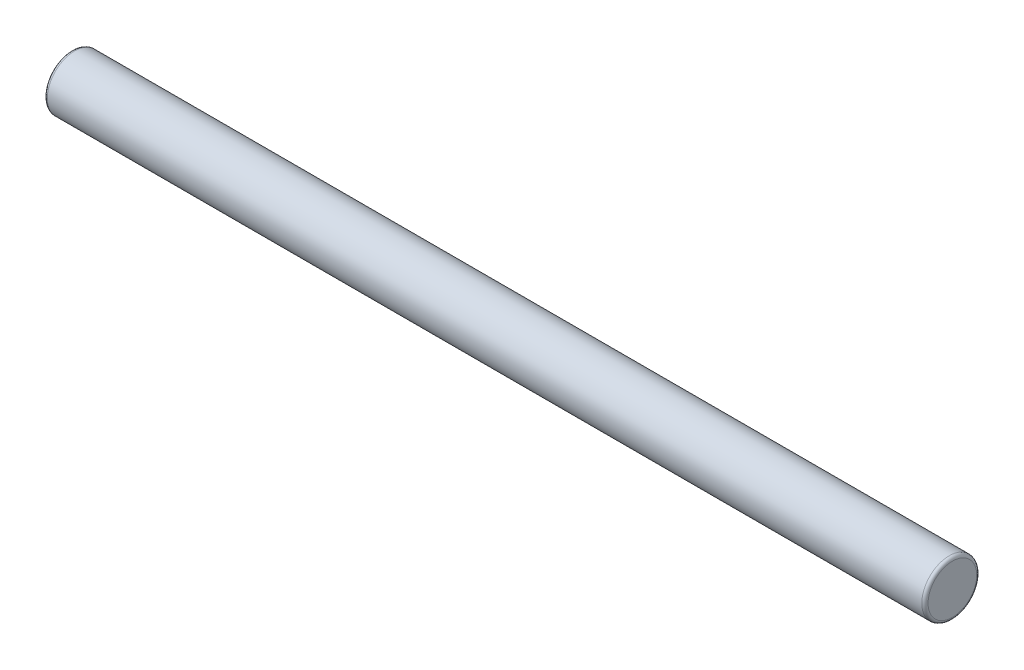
ISO-10303-21;
HEADER;
FILE_DESCRIPTION(('STEP AP214'),'2;1');
FILE_NAME('part.step','',(''),(''),'','','');
FILE_SCHEMA(('AUTOMOTIVE_DESIGN { 1 0 10303 214 1 1 1 1 }'));
ENDSEC;
DATA;
#1=APPLICATION_CONTEXT('core data for automotive mechanical design processes');
#2=APPLICATION_PROTOCOL_DEFINITION('international standard','automotive_design',2000,#1);
#3=PRODUCT_CONTEXT('',#1,'mechanical');
#4=PRODUCT('Part','Part','',(#3));
#5=PRODUCT_RELATED_PRODUCT_CATEGORY('part','',(#4));
#6=PRODUCT_DEFINITION_FORMATION('','',#4);
#7=PRODUCT_DEFINITION_CONTEXT('part definition',#1,'design');
#8=PRODUCT_DEFINITION('design','',#6,#7);
#9=PRODUCT_DEFINITION_SHAPE('','',#8);
#10=(LENGTH_UNIT() NAMED_UNIT(*) SI_UNIT(.MILLI.,.METRE.));
#11=(NAMED_UNIT(*) PLANE_ANGLE_UNIT() SI_UNIT($,.RADIAN.));
#12=(NAMED_UNIT(*) SI_UNIT($,.STERADIAN.) SOLID_ANGLE_UNIT());
#13=UNCERTAINTY_MEASURE_WITH_UNIT(LENGTH_MEASURE(1.E-05),#10,'distance_accuracy_value','');
#14=(GEOMETRIC_REPRESENTATION_CONTEXT(3) GLOBAL_UNCERTAINTY_ASSIGNED_CONTEXT((#13)) GLOBAL_UNIT_ASSIGNED_CONTEXT((#10,
#11,#12)) REPRESENTATION_CONTEXT('',''));
#15=CARTESIAN_POINT('',(0.,0.,0.));
#16=DIRECTION('',(0.,0.,1.));
#17=DIRECTION('',(1.,0.,0.));
#18=AXIS2_PLACEMENT_3D('',#15,#16,#17);
#19=CARTESIAN_POINT('',(-280.5,0.,0.));
#20=DIRECTION('',(1.,0.,0.));
#21=DIRECTION('',(0.,1.,0.));
#22=AXIS2_PLACEMENT_3D('',#19,#20,#21);
#23=PLANE('',#22);
#24=CARTESIAN_POINT('',(-280.5,0.,0.));
#25=DIRECTION('',(1.,0.,0.));
#26=DIRECTION('',(0.,1.,0.));
#27=AXIS2_PLACEMENT_3D('',#24,#25,#26);
#28=CIRCLE('',#27,15.5);
#29=CARTESIAN_POINT('',(-280.5,15.5,0.));
#30=VERTEX_POINT('',#29);
#31=EDGE_CURVE('E55',#30,#30,#28,.F.);
#32=ORIENTED_EDGE('',*,*,#31,.T.);
#33=EDGE_LOOP('',(#32));
#34=FACE_BOUND('',#33,.T.);
#35=ADVANCED_FACE('F37',(#34),#23,.F.);
#36=CARTESIAN_POINT('',(-280.5,0.,0.));
#37=DIRECTION('',(-1.,0.,0.));
#38=DIRECTION('',(0.,-1.,0.));
#39=AXIS2_PLACEMENT_3D('',#36,#37,#38);
#40=CYLINDRICAL_SURFACE('',#39,17.5);
#41=CARTESIAN_POINT('',(-278.5,0.,0.));
#42=DIRECTION('',(1.,0.,0.));
#43=DIRECTION('',(0.,1.,0.));
#44=AXIS2_PLACEMENT_3D('',#41,#42,#43);
#45=CIRCLE('',#44,17.5);
#46=CARTESIAN_POINT('',(-278.5,17.5,0.));
#47=VERTEX_POINT('',#46);
#48=EDGE_CURVE('E45',#47,#47,#45,.T.);
#49=ORIENTED_EDGE('',*,*,#48,.T.);
#50=EDGE_LOOP('',(#49));
#51=FACE_BOUND('',#50,.T.);
#52=CARTESIAN_POINT('',(278.5,1.02686634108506E-13,0.));
#53=DIRECTION('',(-1.,0.,0.));
#54=DIRECTION('',(0.,-1.,0.));
#55=AXIS2_PLACEMENT_3D('',#52,#53,#54);
#56=CIRCLE('',#55,17.5);
#57=CARTESIAN_POINT('',(278.5,-17.4999999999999,0.));
#58=VERTEX_POINT('',#57);
#59=EDGE_CURVE('E50',#58,#58,#56,.T.);
#60=ORIENTED_EDGE('',*,*,#59,.T.);
#61=EDGE_LOOP('',(#60));
#62=FACE_BOUND('',#61,.T.);
#63=ADVANCED_FACE('F72',(#51,#62),#40,.T.);
#64=CARTESIAN_POINT('',(280.5,17.5000000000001,0.));
#65=DIRECTION('',(-1.,0.,0.));
#66=DIRECTION('',(0.,-1.,0.));
#67=AXIS2_PLACEMENT_3D('',#64,#65,#66);
#68=PLANE('',#67);
#69=CARTESIAN_POINT('',(280.5,1.0305402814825E-13,0.));
#70=DIRECTION('',(-1.,0.,0.));
#71=DIRECTION('',(0.,-1.,0.));
#72=AXIS2_PLACEMENT_3D('',#69,#70,#71);
#73=CIRCLE('',#72,15.5);
#74=CARTESIAN_POINT('',(280.5,-15.4999999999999,0.));
#75=VERTEX_POINT('',#74);
#76=EDGE_CURVE('E10',#75,#75,#73,.F.);
#77=ORIENTED_EDGE('',*,*,#76,.T.);
#78=EDGE_LOOP('',(#77));
#79=FACE_BOUND('',#78,.T.);
#80=ADVANCED_FACE('F65',(#79),#68,.F.);
#81=CARTESIAN_POINT('',(-278.5,0.,0.));
#82=DIRECTION('',(1.,0.,0.));
#83=DIRECTION('',(0.,1.,0.));
#84=AXIS2_PLACEMENT_3D('',#81,#82,#83);
#85=TOROIDAL_SURFACE('',#84,15.5,2.);
#86=ORIENTED_EDGE('',*,*,#48,.F.);
#87=EDGE_LOOP('',(#86));
#88=FACE_BOUND('',#87,.T.);
#89=ORIENTED_EDGE('',*,*,#31,.F.);
#90=EDGE_LOOP('',(#89));
#91=FACE_BOUND('',#90,.T.);
#92=ADVANCED_FACE('F63',(#88,#91),#85,.T.);
#93=CARTESIAN_POINT('',(278.5,1.02686634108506E-13,0.));
#94=DIRECTION('',(-1.,0.,0.));
#95=DIRECTION('',(0.,-1.,0.));
#96=AXIS2_PLACEMENT_3D('',#93,#94,#95);
#97=TOROIDAL_SURFACE('',#96,15.5,2.);
#98=ORIENTED_EDGE('',*,*,#76,.F.);
#99=EDGE_LOOP('',(#98));
#100=FACE_BOUND('',#99,.T.);
#101=ORIENTED_EDGE('',*,*,#59,.F.);
#102=EDGE_LOOP('',(#101));
#103=FACE_BOUND('',#102,.T.);
#104=ADVANCED_FACE('F39',(#100,#103),#97,.T.);
#105=CLOSED_SHELL('',(#35,#63,#80,#92,#104));
#106=MANIFOLD_SOLID_BREP('B2',#105);
#107=ADVANCED_BREP_SHAPE_REPRESENTATION('',(#18,#106),#14);
#108=SHAPE_DEFINITION_REPRESENTATION(#9,#107);
ENDSEC;
END-ISO-10303-21;
